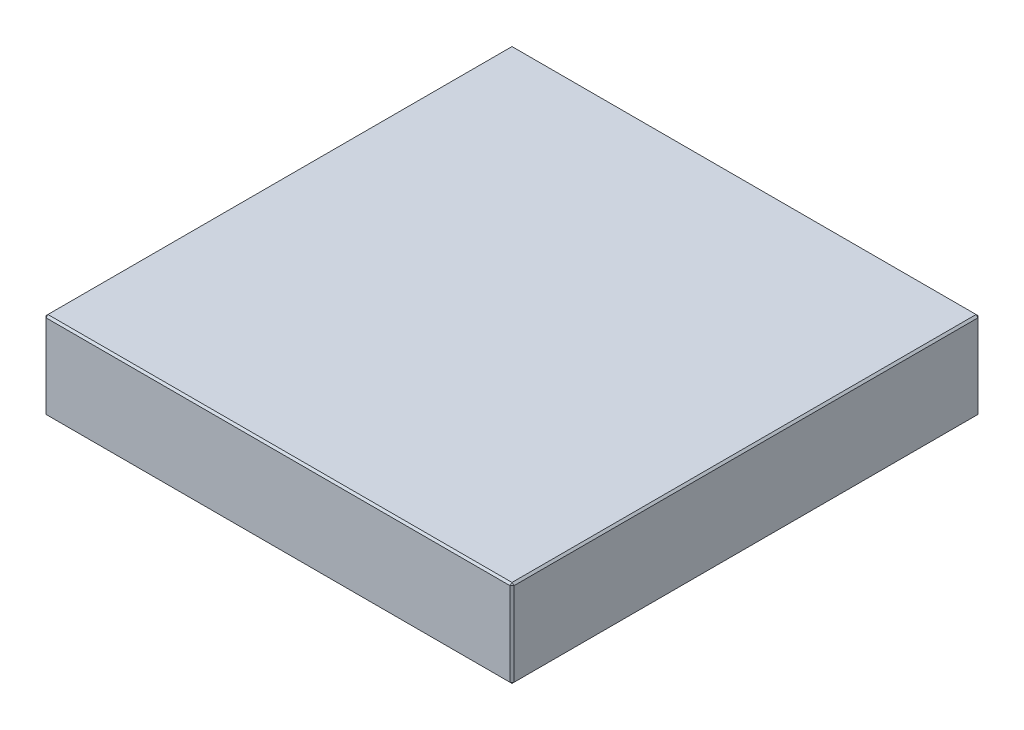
ISO-10303-21;
HEADER;
FILE_DESCRIPTION(('STEP AP214'),'2;1');
FILE_NAME('part.step','',(''),(''),'','','');
FILE_SCHEMA(('AUTOMOTIVE_DESIGN { 1 0 10303 214 1 1 1 1 }'));
ENDSEC;
DATA;
#1=APPLICATION_CONTEXT('core data for automotive mechanical design processes');
#2=APPLICATION_PROTOCOL_DEFINITION('international standard','automotive_design',2000,#1);
#3=PRODUCT_CONTEXT('',#1,'mechanical');
#4=PRODUCT('Part','Part','',(#3));
#5=PRODUCT_RELATED_PRODUCT_CATEGORY('part','',(#4));
#6=PRODUCT_DEFINITION_FORMATION('','',#4);
#7=PRODUCT_DEFINITION_CONTEXT('part definition',#1,'design');
#8=PRODUCT_DEFINITION('design','',#6,#7);
#9=PRODUCT_DEFINITION_SHAPE('','',#8);
#10=(LENGTH_UNIT() NAMED_UNIT(*) SI_UNIT(.MILLI.,.METRE.));
#11=(NAMED_UNIT(*) PLANE_ANGLE_UNIT() SI_UNIT($,.RADIAN.));
#12=(NAMED_UNIT(*) SI_UNIT($,.STERADIAN.) SOLID_ANGLE_UNIT());
#13=UNCERTAINTY_MEASURE_WITH_UNIT(LENGTH_MEASURE(1.E-05),#10,'distance_accuracy_value','');
#14=(GEOMETRIC_REPRESENTATION_CONTEXT(3) GLOBAL_UNCERTAINTY_ASSIGNED_CONTEXT((#13)) GLOBAL_UNIT_ASSIGNED_CONTEXT((#10,
#11,#12)) REPRESENTATION_CONTEXT('',''));
#15=CARTESIAN_POINT('',(0.,0.,0.));
#16=DIRECTION('',(0.,0.,1.));
#17=DIRECTION('',(1.,0.,0.));
#18=AXIS2_PLACEMENT_3D('',#15,#16,#17);
#19=CARTESIAN_POINT('',(-123.,46.,123.));
#20=DIRECTION('',(1.,0.,0.));
#21=DIRECTION('',(0.,0.,-1.));
#22=AXIS2_PLACEMENT_3D('',#19,#20,#21);
#23=PLANE('',#22);
#24=DIRECTION('',(0.,-1.,0.));
#25=VECTOR('',#24,1.);
#26=CARTESIAN_POINT('',(-123.,46.,-122.));
#27=LINE('',#26,#25);
#28=CARTESIAN_POINT('',(-123.,45.,-122.));
#29=VERTEX_POINT('',#28);
#30=CARTESIAN_POINT('',(-123.,0.999999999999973,-122.));
#31=VERTEX_POINT('',#30);
#32=EDGE_CURVE('E115',#29,#31,#27,.T.);
#33=ORIENTED_EDGE('',*,*,#32,.T.);
#34=DIRECTION('',(0.,0.,1.));
#35=VECTOR('',#34,1.);
#36=CARTESIAN_POINT('',(-123.,0.999999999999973,123.));
#37=LINE('',#36,#35);
#38=CARTESIAN_POINT('',(-123.,0.999999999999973,122.));
#39=VERTEX_POINT('',#38);
#40=EDGE_CURVE('E111',#31,#39,#37,.T.);
#41=ORIENTED_EDGE('',*,*,#40,.T.);
#42=DIRECTION('',(0.,1.,0.));
#43=VECTOR('',#42,1.);
#44=CARTESIAN_POINT('',(-123.,46.,122.));
#45=LINE('',#44,#43);
#46=CARTESIAN_POINT('',(-123.,45.,122.));
#47=VERTEX_POINT('',#46);
#48=EDGE_CURVE('E104',#39,#47,#45,.T.);
#49=ORIENTED_EDGE('',*,*,#48,.T.);
#50=DIRECTION('',(0.,0.,-1.));
#51=VECTOR('',#50,1.);
#52=CARTESIAN_POINT('',(-123.,45.,-123.));
#53=LINE('',#52,#51);
#54=EDGE_CURVE('E108',#47,#29,#53,.T.);
#55=ORIENTED_EDGE('',*,*,#54,.T.);
#56=EDGE_LOOP('',(#33,#41,#49,#55));
#57=FACE_BOUND('',#56,.T.);
#58=ADVANCED_FACE('F16',(#57),#23,.F.);
#59=CARTESIAN_POINT('',(123.,46.,123.));
#60=DIRECTION('',(0.,0.,-1.));
#61=DIRECTION('',(-1.,0.,0.));
#62=AXIS2_PLACEMENT_3D('',#59,#60,#61);
#63=PLANE('',#62);
#64=DIRECTION('',(-1.,0.,0.));
#65=VECTOR('',#64,1.);
#66=CARTESIAN_POINT('',(-123.,45.,123.));
#67=LINE('',#66,#65);
#68=CARTESIAN_POINT('',(122.,45.,123.));
#69=VERTEX_POINT('',#68);
#70=CARTESIAN_POINT('',(-122.,45.,123.));
#71=VERTEX_POINT('',#70);
#72=EDGE_CURVE('E165',#69,#71,#67,.T.);
#73=ORIENTED_EDGE('',*,*,#72,.T.);
#74=DIRECTION('',(0.,-1.,0.));
#75=VECTOR('',#74,1.);
#76=CARTESIAN_POINT('',(-122.,46.,123.));
#77=LINE('',#76,#75);
#78=CARTESIAN_POINT('',(-122.,0.999999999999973,123.));
#79=VERTEX_POINT('',#78);
#80=EDGE_CURVE('E123',#71,#79,#77,.T.);
#81=ORIENTED_EDGE('',*,*,#80,.T.);
#82=DIRECTION('',(1.,0.,0.));
#83=VECTOR('',#82,1.);
#84=CARTESIAN_POINT('',(123.,0.999999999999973,123.));
#85=LINE('',#84,#83);
#86=CARTESIAN_POINT('',(122.,0.999999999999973,123.));
#87=VERTEX_POINT('',#86);
#88=EDGE_CURVE('E169',#79,#87,#85,.T.);
#89=ORIENTED_EDGE('',*,*,#88,.T.);
#90=DIRECTION('',(0.,1.,0.));
#91=VECTOR('',#90,1.);
#92=CARTESIAN_POINT('',(122.,46.,123.));
#93=LINE('',#92,#91);
#94=EDGE_CURVE('E167',#87,#69,#93,.T.);
#95=ORIENTED_EDGE('',*,*,#94,.T.);
#96=EDGE_LOOP('',(#73,#81,#89,#95));
#97=FACE_BOUND('',#96,.T.);
#98=ADVANCED_FACE('F276',(#97),#63,.F.);
#99=CARTESIAN_POINT('',(123.,46.,123.));
#100=DIRECTION('',(-1.,0.,0.));
#101=DIRECTION('',(0.,0.,1.));
#102=AXIS2_PLACEMENT_3D('',#99,#100,#101);
#103=PLANE('',#102);
#104=DIRECTION('',(0.,0.,-1.));
#105=VECTOR('',#104,1.);
#106=CARTESIAN_POINT('',(123.,0.999999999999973,123.));
#107=LINE('',#106,#105);
#108=CARTESIAN_POINT('',(123.,0.999999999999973,122.));
#109=VERTEX_POINT('',#108);
#110=CARTESIAN_POINT('',(123.,0.999999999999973,-122.));
#111=VERTEX_POINT('',#110);
#112=EDGE_CURVE('E160',#109,#111,#107,.T.);
#113=ORIENTED_EDGE('',*,*,#112,.T.);
#114=DIRECTION('',(0.,1.,0.));
#115=VECTOR('',#114,1.);
#116=CARTESIAN_POINT('',(123.,46.,-122.));
#117=LINE('',#116,#115);
#118=CARTESIAN_POINT('',(123.,45.,-122.));
#119=VERTEX_POINT('',#118);
#120=EDGE_CURVE('E162',#111,#119,#117,.T.);
#121=ORIENTED_EDGE('',*,*,#120,.T.);
#122=DIRECTION('',(0.,0.,1.));
#123=VECTOR('',#122,1.);
#124=CARTESIAN_POINT('',(123.,45.,123.));
#125=LINE('',#124,#123);
#126=CARTESIAN_POINT('',(123.,45.,122.));
#127=VERTEX_POINT('',#126);
#128=EDGE_CURVE('E156',#119,#127,#125,.T.);
#129=ORIENTED_EDGE('',*,*,#128,.T.);
#130=DIRECTION('',(0.,-1.,0.));
#131=VECTOR('',#130,1.);
#132=CARTESIAN_POINT('',(123.,46.,122.));
#133=LINE('',#132,#131);
#134=EDGE_CURVE('E158',#127,#109,#133,.T.);
#135=ORIENTED_EDGE('',*,*,#134,.T.);
#136=EDGE_LOOP('',(#113,#121,#129,#135));
#137=FACE_BOUND('',#136,.T.);
#138=ADVANCED_FACE('F255',(#137),#103,.F.);
#139=CARTESIAN_POINT('',(123.,46.,-123.));
#140=DIRECTION('',(0.,0.,1.));
#141=DIRECTION('',(1.,0.,0.));
#142=AXIS2_PLACEMENT_3D('',#139,#140,#141);
#143=PLANE('',#142);
#144=DIRECTION('',(0.,-1.,0.));
#145=VECTOR('',#144,1.);
#146=CARTESIAN_POINT('',(122.,46.,-123.));
#147=LINE('',#146,#145);
#148=CARTESIAN_POINT('',(122.,45.,-123.));
#149=VERTEX_POINT('',#148);
#150=CARTESIAN_POINT('',(122.,0.999999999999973,-123.));
#151=VERTEX_POINT('',#150);
#152=EDGE_CURVE('E149',#149,#151,#147,.T.);
#153=ORIENTED_EDGE('',*,*,#152,.T.);
#154=DIRECTION('',(-1.,0.,0.));
#155=VECTOR('',#154,1.);
#156=CARTESIAN_POINT('',(123.,0.999999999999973,-123.));
#157=LINE('',#156,#155);
#158=CARTESIAN_POINT('',(-122.,0.999999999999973,-123.));
#159=VERTEX_POINT('',#158);
#160=EDGE_CURVE('E154',#151,#159,#157,.T.);
#161=ORIENTED_EDGE('',*,*,#160,.T.);
#162=DIRECTION('',(0.,1.,0.));
#163=VECTOR('',#162,1.);
#164=CARTESIAN_POINT('',(-122.,46.,-123.));
#165=LINE('',#164,#163);
#166=CARTESIAN_POINT('',(-122.,45.,-123.));
#167=VERTEX_POINT('',#166);
#168=EDGE_CURVE('E151',#159,#167,#165,.T.);
#169=ORIENTED_EDGE('',*,*,#168,.T.);
#170=DIRECTION('',(1.,0.,0.));
#171=VECTOR('',#170,1.);
#172=CARTESIAN_POINT('',(123.,45.,-123.));
#173=LINE('',#172,#171);
#174=EDGE_CURVE('E147',#167,#149,#173,.T.);
#175=ORIENTED_EDGE('',*,*,#174,.T.);
#176=EDGE_LOOP('',(#153,#161,#169,#175));
#177=FACE_BOUND('',#176,.T.);
#178=ADVANCED_FACE('F285',(#177),#143,.F.);
#179=CARTESIAN_POINT('',(0.,46.,0.));
#180=DIRECTION('',(0.,1.,0.));
#181=DIRECTION('',(0.,0.,1.));
#182=AXIS2_PLACEMENT_3D('',#179,#180,#181);
#183=PLANE('',#182);
#184=DIRECTION('',(0.,0.,-1.));
#185=VECTOR('',#184,1.);
#186=CARTESIAN_POINT('',(122.,46.,-123.));
#187=LINE('',#186,#185);
#188=CARTESIAN_POINT('',(122.,46.,122.));
#189=VERTEX_POINT('',#188);
#190=CARTESIAN_POINT('',(122.,46.,-122.));
#191=VERTEX_POINT('',#190);
#192=EDGE_CURVE('E25',#189,#191,#187,.T.);
#193=ORIENTED_EDGE('',*,*,#192,.T.);
#194=DIRECTION('',(-1.,0.,0.));
#195=VECTOR('',#194,1.);
#196=CARTESIAN_POINT('',(-123.,46.,-122.));
#197=LINE('',#196,#195);
#198=CARTESIAN_POINT('',(-122.,46.,-122.));
#199=VERTEX_POINT('',#198);
#200=EDGE_CURVE('E10',#191,#199,#197,.T.);
#201=ORIENTED_EDGE('',*,*,#200,.T.);
#202=DIRECTION('',(0.,0.,1.));
#203=VECTOR('',#202,1.);
#204=CARTESIAN_POINT('',(-122.,46.,123.));
#205=LINE('',#204,#203);
#206=CARTESIAN_POINT('',(-122.,46.,122.));
#207=VERTEX_POINT('',#206);
#208=EDGE_CURVE('E181',#199,#207,#205,.T.);
#209=ORIENTED_EDGE('',*,*,#208,.T.);
#210=DIRECTION('',(1.,0.,0.));
#211=VECTOR('',#210,1.);
#212=CARTESIAN_POINT('',(123.,46.,122.));
#213=LINE('',#212,#211);
#214=EDGE_CURVE('E36',#207,#189,#213,.T.);
#215=ORIENTED_EDGE('',*,*,#214,.T.);
#216=EDGE_LOOP('',(#193,#201,#209,#215));
#217=FACE_BOUND('',#216,.T.);
#218=ADVANCED_FACE('F351',(#217),#183,.T.);
#219=CARTESIAN_POINT('',(0.,0.,0.));
#220=DIRECTION('',(0.,1.,0.));
#221=DIRECTION('',(0.,0.,1.));
#222=AXIS2_PLACEMENT_3D('',#219,#220,#221);
#223=PLANE('',#222);
#224=DIRECTION('',(0.,0.,1.));
#225=VECTOR('',#224,1.);
#226=CARTESIAN_POINT('',(122.,0.,0.));
#227=LINE('',#226,#225);
#228=CARTESIAN_POINT('',(122.,0.,-122.));
#229=VERTEX_POINT('',#228);
#230=CARTESIAN_POINT('',(122.,0.,122.));
#231=VERTEX_POINT('',#230);
#232=EDGE_CURVE('E172',#229,#231,#227,.T.);
#233=ORIENTED_EDGE('',*,*,#232,.T.);
#234=DIRECTION('',(-1.,0.,0.));
#235=VECTOR('',#234,1.);
#236=CARTESIAN_POINT('',(0.,0.,122.));
#237=LINE('',#236,#235);
#238=CARTESIAN_POINT('',(-122.,0.,122.));
#239=VERTEX_POINT('',#238);
#240=EDGE_CURVE('E178',#231,#239,#237,.T.);
#241=ORIENTED_EDGE('',*,*,#240,.T.);
#242=DIRECTION('',(0.,0.,-1.));
#243=VECTOR('',#242,1.);
#244=CARTESIAN_POINT('',(-122.,0.,0.));
#245=LINE('',#244,#243);
#246=CARTESIAN_POINT('',(-122.,0.,-122.));
#247=VERTEX_POINT('',#246);
#248=EDGE_CURVE('E176',#239,#247,#245,.T.);
#249=ORIENTED_EDGE('',*,*,#248,.T.);
#250=DIRECTION('',(1.,0.,0.));
#251=VECTOR('',#250,1.);
#252=CARTESIAN_POINT('',(0.,0.,-122.));
#253=LINE('',#252,#251);
#254=EDGE_CURVE('E174',#247,#229,#253,.T.);
#255=ORIENTED_EDGE('',*,*,#254,.T.);
#256=EDGE_LOOP('',(#233,#241,#249,#255));
#257=FACE_BOUND('',#256,.T.);
#258=ADVANCED_FACE('F247',(#257),#223,.F.);
#259=CARTESIAN_POINT('',(123.,46.,122.));
#260=DIRECTION('',(-0.707106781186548,0.,-0.707106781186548));
#261=DIRECTION('',(0.,-1.,0.));
#262=AXIS2_PLACEMENT_3D('',#259,#260,#261);
#263=PLANE('',#262);
#264=DIRECTION('',(-0.707106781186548,0.,0.707106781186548));
#265=VECTOR('',#264,1.);
#266=CARTESIAN_POINT('',(122.,45.,123.));
#267=LINE('',#266,#265);
#268=EDGE_CURVE('E20',#69,#127,#267,.F.);
#269=ORIENTED_EDGE('',*,*,#268,.F.);
#270=ORIENTED_EDGE('',*,*,#94,.F.);
#271=DIRECTION('',(0.707106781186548,0.,-0.707106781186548));
#272=VECTOR('',#271,1.);
#273=CARTESIAN_POINT('',(122.,0.999999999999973,123.));
#274=LINE('',#273,#272);
#275=EDGE_CURVE('E143',#109,#87,#274,.F.);
#276=ORIENTED_EDGE('',*,*,#275,.F.);
#277=ORIENTED_EDGE('',*,*,#134,.F.);
#278=EDGE_LOOP('',(#269,#270,#276,#277));
#279=FACE_BOUND('',#278,.T.);
#280=ADVANCED_FACE('F18',(#279),#263,.F.);
#281=CARTESIAN_POINT('',(122.,45.,123.));
#282=DIRECTION('',(0.577350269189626,0.577350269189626,0.577350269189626));
#283=DIRECTION('',(0.707106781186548,0.,-0.707106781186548));
#284=AXIS2_PLACEMENT_3D('',#281,#282,#283);
#285=PLANE('',#284);
#286=DIRECTION('',(0.,-0.707106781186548,0.707106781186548));
#287=VECTOR('',#286,1.);
#288=CARTESIAN_POINT('',(122.,45.,123.));
#289=LINE('',#288,#287);
#290=EDGE_CURVE('E227',#69,#189,#289,.F.);
#291=ORIENTED_EDGE('',*,*,#290,.F.);
#292=ORIENTED_EDGE('',*,*,#268,.T.);
#293=DIRECTION('',(-0.707106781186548,0.707106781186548,0.));
#294=VECTOR('',#293,1.);
#295=CARTESIAN_POINT('',(122.5,45.5,122.));
#296=LINE('',#295,#294);
#297=EDGE_CURVE('E229',#189,#127,#296,.F.);
#298=ORIENTED_EDGE('',*,*,#297,.F.);
#299=EDGE_LOOP('',(#291,#292,#298));
#300=FACE_BOUND('',#299,.T.);
#301=ADVANCED_FACE('F271',(#300),#285,.T.);
#302=CARTESIAN_POINT('',(122.,0.999999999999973,123.));
#303=DIRECTION('',(0.577350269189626,-0.577350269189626,0.577350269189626));
#304=DIRECTION('',(0.707106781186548,0.,-0.707106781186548));
#305=AXIS2_PLACEMENT_3D('',#302,#303,#304);
#306=PLANE('',#305);
#307=DIRECTION('',(-0.707106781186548,-0.707106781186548,0.));
#308=VECTOR('',#307,1.);
#309=CARTESIAN_POINT('',(122.5,0.499999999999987,122.));
#310=LINE('',#309,#308);
#311=EDGE_CURVE('E221',#109,#231,#310,.T.);
#312=ORIENTED_EDGE('',*,*,#311,.F.);
#313=ORIENTED_EDGE('',*,*,#275,.T.);
#314=DIRECTION('',(0.,0.707106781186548,0.707106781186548));
#315=VECTOR('',#314,1.);
#316=CARTESIAN_POINT('',(122.,0.999999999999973,123.));
#317=LINE('',#316,#315);
#318=EDGE_CURVE('E224',#231,#87,#317,.T.);
#319=ORIENTED_EDGE('',*,*,#318,.F.);
#320=EDGE_LOOP('',(#312,#313,#319));
#321=FACE_BOUND('',#320,.T.);
#322=ADVANCED_FACE('F236',(#321),#306,.T.);
#323=CARTESIAN_POINT('',(122.,46.,0.));
#324=DIRECTION('',(0.707106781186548,0.707106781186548,0.));
#325=DIRECTION('',(0.,0.,1.));
#326=AXIS2_PLACEMENT_3D('',#323,#324,#325);
#327=PLANE('',#326);
#328=ORIENTED_EDGE('',*,*,#297,.T.);
#329=ORIENTED_EDGE('',*,*,#128,.F.);
#330=DIRECTION('',(0.707106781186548,-0.707106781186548,0.));
#331=VECTOR('',#330,1.);
#332=CARTESIAN_POINT('',(123.,45.,-122.));
#333=LINE('',#332,#331);
#334=EDGE_CURVE('E216',#191,#119,#333,.T.);
#335=ORIENTED_EDGE('',*,*,#334,.F.);
#336=ORIENTED_EDGE('',*,*,#192,.F.);
#337=EDGE_LOOP('',(#328,#329,#335,#336));
#338=FACE_BOUND('',#337,.T.);
#339=ADVANCED_FACE('F266',(#338),#327,.T.);
#340=CARTESIAN_POINT('',(0.,46.,122.));
#341=DIRECTION('',(0.,0.707106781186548,0.707106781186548));
#342=DIRECTION('',(-1.,0.,0.));
#343=AXIS2_PLACEMENT_3D('',#340,#341,#342);
#344=PLANE('',#343);
#345=ORIENTED_EDGE('',*,*,#290,.T.);
#346=ORIENTED_EDGE('',*,*,#214,.F.);
#347=DIRECTION('',(0.,0.707106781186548,-0.707106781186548));
#348=VECTOR('',#347,1.);
#349=CARTESIAN_POINT('',(-122.,45.5,122.5));
#350=LINE('',#349,#348);
#351=EDGE_CURVE('E127',#71,#207,#350,.T.);
#352=ORIENTED_EDGE('',*,*,#351,.F.);
#353=ORIENTED_EDGE('',*,*,#72,.F.);
#354=EDGE_LOOP('',(#345,#346,#352,#353));
#355=FACE_BOUND('',#354,.T.);
#356=ADVANCED_FACE('F274',(#355),#344,.T.);
#357=CARTESIAN_POINT('',(-122.,46.,123.));
#358=DIRECTION('',(0.707106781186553,0.,-0.707106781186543));
#359=DIRECTION('',(0.,-1.,0.));
#360=AXIS2_PLACEMENT_3D('',#357,#358,#359);
#361=PLANE('',#360);
#362=DIRECTION('',(0.707106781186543,0.,0.707106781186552));
#363=VECTOR('',#362,1.);
#364=CARTESIAN_POINT('',(-122.,0.999999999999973,123.));
#365=LINE('',#364,#363);
#366=EDGE_CURVE('E128',#79,#39,#365,.F.);
#367=ORIENTED_EDGE('',*,*,#366,.F.);
#368=ORIENTED_EDGE('',*,*,#80,.F.);
#369=DIRECTION('',(-0.707106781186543,0.,-0.707106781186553));
#370=VECTOR('',#369,1.);
#371=CARTESIAN_POINT('',(-123.,45.,122.));
#372=LINE('',#371,#370);
#373=EDGE_CURVE('E119',#47,#71,#372,.F.);
#374=ORIENTED_EDGE('',*,*,#373,.F.);
#375=ORIENTED_EDGE('',*,*,#48,.F.);
#376=EDGE_LOOP('',(#367,#368,#374,#375));
#377=FACE_BOUND('',#376,.T.);
#378=ADVANCED_FACE('F121',(#377),#361,.F.);
#379=CARTESIAN_POINT('',(123.,0.999999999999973,123.));
#380=DIRECTION('',(0.,0.707106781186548,-0.707106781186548));
#381=DIRECTION('',(1.,0.,0.));
#382=AXIS2_PLACEMENT_3D('',#379,#380,#381);
#383=PLANE('',#382);
#384=ORIENTED_EDGE('',*,*,#318,.T.);
#385=ORIENTED_EDGE('',*,*,#88,.F.);
#386=DIRECTION('',(0.,-0.707106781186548,-0.707106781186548));
#387=VECTOR('',#386,1.);
#388=CARTESIAN_POINT('',(-122.,0.999999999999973,123.));
#389=LINE('',#388,#387);
#390=EDGE_CURVE('E212',#239,#79,#389,.F.);
#391=ORIENTED_EDGE('',*,*,#390,.F.);
#392=ORIENTED_EDGE('',*,*,#240,.F.);
#393=EDGE_LOOP('',(#384,#385,#391,#392));
#394=FACE_BOUND('',#393,.T.);
#395=ADVANCED_FACE('F244',(#394),#383,.F.);
#396=CARTESIAN_POINT('',(123.,0.999999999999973,123.));
#397=DIRECTION('',(-0.707106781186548,0.707106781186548,0.));
#398=DIRECTION('',(0.,0.,-1.));
#399=AXIS2_PLACEMENT_3D('',#396,#397,#398);
#400=PLANE('',#399);
#401=ORIENTED_EDGE('',*,*,#311,.T.);
#402=ORIENTED_EDGE('',*,*,#232,.F.);
#403=DIRECTION('',(0.707106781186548,0.707106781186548,0.));
#404=VECTOR('',#403,1.);
#405=CARTESIAN_POINT('',(122.5,0.49999999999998,-122.));
#406=LINE('',#405,#404);
#407=EDGE_CURVE('E209',#111,#229,#406,.F.);
#408=ORIENTED_EDGE('',*,*,#407,.F.);
#409=ORIENTED_EDGE('',*,*,#112,.F.);
#410=EDGE_LOOP('',(#401,#402,#408,#409));
#411=FACE_BOUND('',#410,.T.);
#412=ADVANCED_FACE('F252',(#411),#400,.F.);
#413=CARTESIAN_POINT('',(122.,46.,-123.));
#414=DIRECTION('',(-0.707106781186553,0.,0.707106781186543));
#415=DIRECTION('',(0.,-1.,0.));
#416=AXIS2_PLACEMENT_3D('',#413,#414,#415);
#417=PLANE('',#416);
#418=DIRECTION('',(0.707106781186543,0.,0.707106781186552));
#419=VECTOR('',#418,1.);
#420=CARTESIAN_POINT('',(123.,45.,-122.));
#421=LINE('',#420,#419);
#422=EDGE_CURVE('E218',#119,#149,#421,.F.);
#423=ORIENTED_EDGE('',*,*,#422,.F.);
#424=ORIENTED_EDGE('',*,*,#120,.F.);
#425=DIRECTION('',(-0.707106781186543,0.,-0.707106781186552));
#426=VECTOR('',#425,1.);
#427=CARTESIAN_POINT('',(122.,0.999999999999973,-123.));
#428=LINE('',#427,#426);
#429=EDGE_CURVE('E206',#151,#111,#428,.F.);
#430=ORIENTED_EDGE('',*,*,#429,.F.);
#431=ORIENTED_EDGE('',*,*,#152,.F.);
#432=EDGE_LOOP('',(#423,#424,#430,#431));
#433=FACE_BOUND('',#432,.T.);
#434=ADVANCED_FACE('F259',(#433),#417,.F.);
#435=CARTESIAN_POINT('',(123.,45.,-122.));
#436=DIRECTION('',(0.577350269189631,0.577350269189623,-0.577350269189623));
#437=DIRECTION('',(-0.707106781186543,0.,-0.707106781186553));
#438=AXIS2_PLACEMENT_3D('',#435,#436,#437);
#439=PLANE('',#438);
#440=ORIENTED_EDGE('',*,*,#334,.T.);
#441=ORIENTED_EDGE('',*,*,#422,.T.);
#442=DIRECTION('',(0.,0.70710678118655,0.707106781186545));
#443=VECTOR('',#442,1.);
#444=CARTESIAN_POINT('',(122.,45.5,-122.5));
#445=LINE('',#444,#443);
#446=EDGE_CURVE('E135',#191,#149,#445,.F.);
#447=ORIENTED_EDGE('',*,*,#446,.F.);
#448=EDGE_LOOP('',(#440,#441,#447));
#449=FACE_BOUND('',#448,.T.);
#450=ADVANCED_FACE('F326',(#449),#439,.T.);
#451=CARTESIAN_POINT('',(-123.,45.,122.));
#452=DIRECTION('',(-0.577350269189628,0.577350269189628,0.577350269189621));
#453=DIRECTION('',(-0.707106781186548,-0.707106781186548,0.));
#454=AXIS2_PLACEMENT_3D('',#451,#452,#453);
#455=PLANE('',#454);
#456=ORIENTED_EDGE('',*,*,#373,.T.);
#457=ORIENTED_EDGE('',*,*,#351,.T.);
#458=DIRECTION('',(-0.707106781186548,-0.707106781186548,0.));
#459=VECTOR('',#458,1.);
#460=CARTESIAN_POINT('',(-123.,45.,122.));
#461=LINE('',#460,#459);
#462=EDGE_CURVE('E131',#47,#207,#461,.F.);
#463=ORIENTED_EDGE('',*,*,#462,.F.);
#464=EDGE_LOOP('',(#456,#457,#463));
#465=FACE_BOUND('',#464,.T.);
#466=ADVANCED_FACE('F132',(#465),#455,.T.);
#467=CARTESIAN_POINT('',(-122.,0.999999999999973,123.));
#468=DIRECTION('',(-0.577350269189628,-0.577350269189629,0.57735026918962));
#469=DIRECTION('',(0.707106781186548,-0.707106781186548,0.));
#470=AXIS2_PLACEMENT_3D('',#467,#468,#469);
#471=PLANE('',#470);
#472=ORIENTED_EDGE('',*,*,#390,.T.);
#473=ORIENTED_EDGE('',*,*,#366,.T.);
#474=DIRECTION('',(-0.707106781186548,0.707106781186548,0.));
#475=VECTOR('',#474,1.);
#476=CARTESIAN_POINT('',(-122.5,0.499999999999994,122.));
#477=LINE('',#476,#475);
#478=EDGE_CURVE('E136',#239,#39,#477,.T.);
#479=ORIENTED_EDGE('',*,*,#478,.F.);
#480=EDGE_LOOP('',(#472,#473,#479));
#481=FACE_BOUND('',#480,.T.);
#482=ADVANCED_FACE('F319',(#481),#471,.T.);
#483=CARTESIAN_POINT('',(122.,0.999999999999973,-123.));
#484=DIRECTION('',(0.577350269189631,-0.577350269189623,-0.577350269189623));
#485=DIRECTION('',(-0.707106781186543,0.,-0.707106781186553));
#486=AXIS2_PLACEMENT_3D('',#483,#484,#485);
#487=PLANE('',#486);
#488=ORIENTED_EDGE('',*,*,#429,.T.);
#489=ORIENTED_EDGE('',*,*,#407,.T.);
#490=DIRECTION('',(0.,-0.70710678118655,0.707106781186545));
#491=VECTOR('',#490,1.);
#492=CARTESIAN_POINT('',(122.,0.999999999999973,-123.));
#493=LINE('',#492,#491);
#494=EDGE_CURVE('E199',#151,#229,#493,.T.);
#495=ORIENTED_EDGE('',*,*,#494,.F.);
#496=EDGE_LOOP('',(#488,#489,#495));
#497=FACE_BOUND('',#496,.T.);
#498=ADVANCED_FACE('F315',(#497),#487,.T.);
#499=CARTESIAN_POINT('',(0.,46.,-122.));
#500=DIRECTION('',(0.,0.707106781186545,-0.70710678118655));
#501=DIRECTION('',(1.,0.,0.));
#502=AXIS2_PLACEMENT_3D('',#499,#500,#501);
#503=PLANE('',#502);
#504=ORIENTED_EDGE('',*,*,#446,.T.);
#505=ORIENTED_EDGE('',*,*,#174,.F.);
#506=DIRECTION('',(0.,-0.70710678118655,-0.707106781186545));
#507=VECTOR('',#506,1.);
#508=CARTESIAN_POINT('',(-122.,45.,-123.));
#509=LINE('',#508,#507);
#510=EDGE_CURVE('E196',#199,#167,#509,.T.);
#511=ORIENTED_EDGE('',*,*,#510,.F.);
#512=ORIENTED_EDGE('',*,*,#200,.F.);
#513=EDGE_LOOP('',(#504,#505,#511,#512));
#514=FACE_BOUND('',#513,.T.);
#515=ADVANCED_FACE('F312',(#514),#503,.T.);
#516=CARTESIAN_POINT('',(-122.,46.,0.));
#517=DIRECTION('',(-0.707106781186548,0.707106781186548,0.));
#518=DIRECTION('',(0.,0.,-1.));
#519=AXIS2_PLACEMENT_3D('',#516,#517,#518);
#520=PLANE('',#519);
#521=ORIENTED_EDGE('',*,*,#462,.T.);
#522=ORIENTED_EDGE('',*,*,#208,.F.);
#523=DIRECTION('',(0.707106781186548,0.707106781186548,0.));
#524=VECTOR('',#523,1.);
#525=CARTESIAN_POINT('',(-122.5,45.5,-122.));
#526=LINE('',#525,#524);
#527=EDGE_CURVE('E139',#29,#199,#526,.T.);
#528=ORIENTED_EDGE('',*,*,#527,.F.);
#529=ORIENTED_EDGE('',*,*,#54,.F.);
#530=EDGE_LOOP('',(#521,#522,#528,#529));
#531=FACE_BOUND('',#530,.T.);
#532=ADVANCED_FACE('F138',(#531),#520,.T.);
#533=CARTESIAN_POINT('',(-123.,0.999999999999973,123.));
#534=DIRECTION('',(0.707106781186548,0.707106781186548,0.));
#535=DIRECTION('',(0.,0.,1.));
#536=AXIS2_PLACEMENT_3D('',#533,#534,#535);
#537=PLANE('',#536);
#538=ORIENTED_EDGE('',*,*,#478,.T.);
#539=ORIENTED_EDGE('',*,*,#40,.F.);
#540=DIRECTION('',(0.707106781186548,-0.707106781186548,0.));
#541=VECTOR('',#540,1.);
#542=CARTESIAN_POINT('',(-123.,0.999999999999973,-122.));
#543=LINE('',#542,#541);
#544=EDGE_CURVE('E192',#247,#31,#543,.F.);
#545=ORIENTED_EDGE('',*,*,#544,.F.);
#546=ORIENTED_EDGE('',*,*,#248,.F.);
#547=EDGE_LOOP('',(#538,#539,#545,#546));
#548=FACE_BOUND('',#547,.T.);
#549=ADVANCED_FACE('F305',(#548),#537,.F.);
#550=CARTESIAN_POINT('',(123.,0.999999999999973,-123.));
#551=DIRECTION('',(0.,0.707106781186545,0.70710678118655));
#552=DIRECTION('',(-1.,0.,0.));
#553=AXIS2_PLACEMENT_3D('',#550,#551,#552);
#554=PLANE('',#553);
#555=ORIENTED_EDGE('',*,*,#494,.T.);
#556=ORIENTED_EDGE('',*,*,#254,.F.);
#557=DIRECTION('',(0.,0.70710678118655,-0.707106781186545));
#558=VECTOR('',#557,1.);
#559=CARTESIAN_POINT('',(-122.,0.500000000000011,-122.5));
#560=LINE('',#559,#558);
#561=EDGE_CURVE('E189',#159,#247,#560,.F.);
#562=ORIENTED_EDGE('',*,*,#561,.F.);
#563=ORIENTED_EDGE('',*,*,#160,.F.);
#564=EDGE_LOOP('',(#555,#556,#562,#563));
#565=FACE_BOUND('',#564,.T.);
#566=ADVANCED_FACE('F301',(#565),#554,.F.);
#567=CARTESIAN_POINT('',(-122.,45.,-123.));
#568=DIRECTION('',(-0.577350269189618,0.577350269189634,-0.577350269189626));
#569=DIRECTION('',(0.,0.707106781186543,0.707106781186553));
#570=AXIS2_PLACEMENT_3D('',#567,#568,#569);
#571=PLANE('',#570);
#572=ORIENTED_EDGE('',*,*,#527,.T.);
#573=ORIENTED_EDGE('',*,*,#510,.T.);
#574=DIRECTION('',(0.707106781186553,0.,-0.707106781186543));
#575=VECTOR('',#574,1.);
#576=CARTESIAN_POINT('',(-122.,45.,-123.));
#577=LINE('',#576,#575);
#578=EDGE_CURVE('E187',#29,#167,#577,.T.);
#579=ORIENTED_EDGE('',*,*,#578,.F.);
#580=EDGE_LOOP('',(#572,#573,#579));
#581=FACE_BOUND('',#580,.T.);
#582=ADVANCED_FACE('F297',(#581),#571,.T.);
#583=CARTESIAN_POINT('',(-123.,0.999999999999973,-122.));
#584=DIRECTION('',(-0.577350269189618,-0.577350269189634,-0.577350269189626));
#585=DIRECTION('',(0.,0.707106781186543,-0.707106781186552));
#586=AXIS2_PLACEMENT_3D('',#583,#584,#585);
#587=PLANE('',#586);
#588=ORIENTED_EDGE('',*,*,#561,.T.);
#589=ORIENTED_EDGE('',*,*,#544,.T.);
#590=DIRECTION('',(-0.707106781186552,0.,0.707106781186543));
#591=VECTOR('',#590,1.);
#592=CARTESIAN_POINT('',(-123.,0.999999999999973,-122.));
#593=LINE('',#592,#591);
#594=EDGE_CURVE('E185',#159,#31,#593,.T.);
#595=ORIENTED_EDGE('',*,*,#594,.F.);
#596=EDGE_LOOP('',(#588,#589,#595));
#597=FACE_BOUND('',#596,.T.);
#598=ADVANCED_FACE('F293',(#597),#587,.T.);
#599=CARTESIAN_POINT('',(-123.,46.,-122.));
#600=DIRECTION('',(0.707106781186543,0.,0.707106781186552));
#601=DIRECTION('',(0.,-1.,0.));
#602=AXIS2_PLACEMENT_3D('',#599,#600,#601);
#603=PLANE('',#602);
#604=ORIENTED_EDGE('',*,*,#578,.T.);
#605=ORIENTED_EDGE('',*,*,#168,.F.);
#606=ORIENTED_EDGE('',*,*,#594,.T.);
#607=ORIENTED_EDGE('',*,*,#32,.F.);
#608=EDGE_LOOP('',(#604,#605,#606,#607));
#609=FACE_BOUND('',#608,.T.);
#610=ADVANCED_FACE('F290',(#609),#603,.F.);
#611=CLOSED_SHELL('',(#58,#98,#138,#178,#218,#258,#280,#301,#322,#339,#356,#378,#395,#412,#434,
#450,#466,#482,#498,#515,#532,#549,#566,#582,#598,#610));
#612=MANIFOLD_SOLID_BREP('B1',#611);
#613=ADVANCED_BREP_SHAPE_REPRESENTATION('',(#18,#612),#14);
#614=SHAPE_DEFINITION_REPRESENTATION(#9,#613);
ENDSEC;
END-ISO-10303-21;
